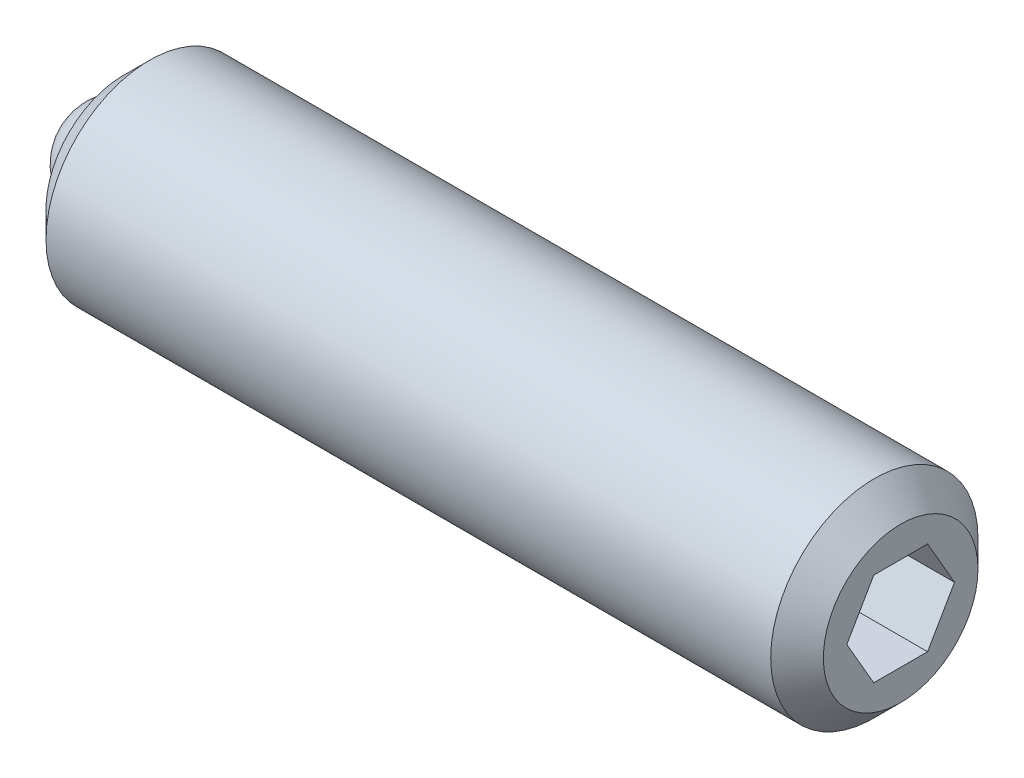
ISO-10303-21;
HEADER;
FILE_DESCRIPTION(('STEP AP214'),'2;1');
FILE_NAME('part.step','',(''),(''),'','','');
FILE_SCHEMA(('AUTOMOTIVE_DESIGN { 1 0 10303 214 1 1 1 1 }'));
ENDSEC;
DATA;
#1=APPLICATION_CONTEXT('core data for automotive mechanical design processes');
#2=APPLICATION_PROTOCOL_DEFINITION('international standard','automotive_design',2000,#1);
#3=PRODUCT_CONTEXT('',#1,'mechanical');
#4=PRODUCT('Part','Part','',(#3));
#5=PRODUCT_RELATED_PRODUCT_CATEGORY('part','',(#4));
#6=PRODUCT_DEFINITION_FORMATION('','',#4);
#7=PRODUCT_DEFINITION_CONTEXT('part definition',#1,'design');
#8=PRODUCT_DEFINITION('design','',#6,#7);
#9=PRODUCT_DEFINITION_SHAPE('','',#8);
#10=(LENGTH_UNIT() NAMED_UNIT(*) SI_UNIT(.MILLI.,.METRE.));
#11=(NAMED_UNIT(*) PLANE_ANGLE_UNIT() SI_UNIT($,.RADIAN.));
#12=(NAMED_UNIT(*) SI_UNIT($,.STERADIAN.) SOLID_ANGLE_UNIT());
#13=UNCERTAINTY_MEASURE_WITH_UNIT(LENGTH_MEASURE(1.E-05),#10,'distance_accuracy_value','');
#14=(GEOMETRIC_REPRESENTATION_CONTEXT(3) GLOBAL_UNCERTAINTY_ASSIGNED_CONTEXT((#13)) GLOBAL_UNIT_ASSIGNED_CONTEXT((#10,
#11,#12)) REPRESENTATION_CONTEXT('',''));
#15=CARTESIAN_POINT('',(0.,0.,0.));
#16=DIRECTION('',(0.,0.,1.));
#17=DIRECTION('',(1.,0.,0.));
#18=AXIS2_PLACEMENT_3D('',#15,#16,#17);
#19=CARTESIAN_POINT('',(0.,0.,0.));
#20=DIRECTION('',(0.,-1.,0.));
#21=DIRECTION('',(0.,0.,-1.));
#22=AXIS2_PLACEMENT_3D('',#19,#20,#21);
#23=SPHERICAL_SURFACE('',#22,0.5);
#24=CARTESIAN_POINT('',(0.,-0.5,0.));
#25=VERTEX_POINT('',#24);
#26=VERTEX_LOOP('',#25);
#27=FACE_BOUND('',#26,.T.);
#28=ADVANCED_FACE('F41',(#27),#23,.T.);
#29=CLOSED_SHELL('',(#28));
#30=MANIFOLD_SOLID_BREP('B2',#29);
#31=CARTESIAN_POINT('',(7.5,0.,0.));
#32=DIRECTION('',(-1.,0.,0.));
#33=DIRECTION('',(0.,0.,1.));
#34=AXIS2_PLACEMENT_3D('',#31,#32,#33);
#35=CYLINDRICAL_SURFACE('',#34,1.);
#36=CARTESIAN_POINT('',(7.246,0.,0.));
#37=DIRECTION('',(1.,0.,0.));
#38=DIRECTION('',(0.,0.,-1.));
#39=AXIS2_PLACEMENT_3D('',#36,#37,#38);
#40=CIRCLE('',#39,1.);
#41=CARTESIAN_POINT('',(7.246,0.,-1.));
#42=VERTEX_POINT('',#41);
#43=EDGE_CURVE('E39',#42,#42,#40,.F.);
#44=ORIENTED_EDGE('',*,*,#43,.T.);
#45=EDGE_LOOP('',(#44));
#46=FACE_BOUND('',#45,.T.);
#47=CARTESIAN_POINT('',(0.254000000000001,0.,0.));
#48=DIRECTION('',(1.,0.,0.));
#49=DIRECTION('',(0.,0.,-1.));
#50=AXIS2_PLACEMENT_3D('',#47,#48,#49);
#51=CIRCLE('',#50,1.);
#52=CARTESIAN_POINT('',(0.254000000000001,0.,-1.));
#53=VERTEX_POINT('',#52);
#54=EDGE_CURVE('E157',#53,#53,#51,.T.);
#55=ORIENTED_EDGE('',*,*,#54,.T.);
#56=EDGE_LOOP('',(#55));
#57=FACE_BOUND('',#56,.T.);
#58=ADVANCED_FACE('F54',(#46,#57),#35,.T.);
#59=CARTESIAN_POINT('',(7.5,0.,0.));
#60=DIRECTION('',(1.,0.,0.));
#61=DIRECTION('',(0.,0.,-1.));
#62=AXIS2_PLACEMENT_3D('',#59,#60,#61);
#63=PLANE('',#62);
#64=DIRECTION('',(0.,0.866025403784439,-0.5));
#65=VECTOR('',#64,1.);
#66=CARTESIAN_POINT('',(7.5,-0.45,-0.259807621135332));
#67=LINE('',#66,#65);
#68=CARTESIAN_POINT('',(7.5,-0.45,-0.259807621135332));
#69=VERTEX_POINT('',#68);
#70=CARTESIAN_POINT('',(7.5,0.,-0.519615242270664));
#71=VERTEX_POINT('',#70);
#72=EDGE_CURVE('E69',#69,#71,#67,.T.);
#73=ORIENTED_EDGE('',*,*,#72,.F.);
#74=DIRECTION('',(0.,0.,-1.));
#75=VECTOR('',#74,1.);
#76=CARTESIAN_POINT('',(7.5,-0.45,0.259807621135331));
#77=LINE('',#76,#75);
#78=CARTESIAN_POINT('',(7.5,-0.45,0.259807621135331));
#79=VERTEX_POINT('',#78);
#80=EDGE_CURVE('E153',#79,#69,#77,.T.);
#81=ORIENTED_EDGE('',*,*,#80,.F.);
#82=DIRECTION('',(0.,-0.866025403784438,-0.5));
#83=VECTOR('',#82,1.);
#84=CARTESIAN_POINT('',(7.5,0.,0.519615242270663));
#85=LINE('',#84,#83);
#86=CARTESIAN_POINT('',(7.5,0.,0.519615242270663));
#87=VERTEX_POINT('',#86);
#88=EDGE_CURVE('E151',#87,#79,#85,.T.);
#89=ORIENTED_EDGE('',*,*,#88,.F.);
#90=DIRECTION('',(0.,-0.866025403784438,0.5));
#91=VECTOR('',#90,1.);
#92=CARTESIAN_POINT('',(7.5,0.45,0.259807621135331));
#93=LINE('',#92,#91);
#94=CARTESIAN_POINT('',(7.5,0.45,0.259807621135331));
#95=VERTEX_POINT('',#94);
#96=EDGE_CURVE('E117',#95,#87,#93,.T.);
#97=ORIENTED_EDGE('',*,*,#96,.F.);
#98=DIRECTION('',(0.,0.,1.));
#99=VECTOR('',#98,1.);
#100=CARTESIAN_POINT('',(7.5,0.45,-0.259807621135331));
#101=LINE('',#100,#99);
#102=CARTESIAN_POINT('',(7.5,0.45,-0.259807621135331));
#103=VERTEX_POINT('',#102);
#104=EDGE_CURVE('E147',#103,#95,#101,.T.);
#105=ORIENTED_EDGE('',*,*,#104,.F.);
#106=DIRECTION('',(0.,0.866025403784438,0.5));
#107=VECTOR('',#106,1.);
#108=CARTESIAN_POINT('',(7.5,0.,-0.519615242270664));
#109=LINE('',#108,#107);
#110=EDGE_CURVE('E143',#71,#103,#109,.T.);
#111=ORIENTED_EDGE('',*,*,#110,.F.);
#112=EDGE_LOOP('',(#73,#81,#89,#97,#105,#111));
#113=FACE_BOUND('',#112,.T.);
#114=CARTESIAN_POINT('',(7.5,0.,0.));
#115=DIRECTION('',(1.,0.,0.));
#116=DIRECTION('',(0.,0.,-1.));
#117=AXIS2_PLACEMENT_3D('',#114,#115,#116);
#118=CIRCLE('',#117,0.746000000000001);
#119=CARTESIAN_POINT('',(7.5,0.,-0.746000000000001));
#120=VERTEX_POINT('',#119);
#121=EDGE_CURVE('E62',#120,#120,#118,.T.);
#122=ORIENTED_EDGE('',*,*,#121,.T.);
#123=EDGE_LOOP('',(#122));
#124=FACE_BOUND('',#123,.T.);
#125=ADVANCED_FACE('F170',(#113,#124),#63,.T.);
#126=CARTESIAN_POINT('',(0.,0.,0.));
#127=DIRECTION('',(1.,0.,0.));
#128=DIRECTION('',(0.,0.,-1.));
#129=AXIS2_PLACEMENT_3D('',#126,#127,#128);
#130=PLANE('',#129);
#131=CARTESIAN_POINT('',(0.,0.,0.));
#132=DIRECTION('',(-1.,0.,0.));
#133=DIRECTION('',(0.,0.,1.));
#134=AXIS2_PLACEMENT_3D('',#131,#132,#133);
#135=CIRCLE('',#134,0.5);
#136=CARTESIAN_POINT('',(0.,0.,0.5));
#137=VERTEX_POINT('',#136);
#138=EDGE_CURVE('E225',#137,#137,#135,.T.);
#139=ORIENTED_EDGE('',*,*,#138,.F.);
#140=EDGE_LOOP('',(#139));
#141=FACE_BOUND('',#140,.T.);
#142=CARTESIAN_POINT('',(0.,0.,0.));
#143=DIRECTION('',(1.,0.,0.));
#144=DIRECTION('',(0.,0.,-1.));
#145=AXIS2_PLACEMENT_3D('',#142,#143,#144);
#146=CIRCLE('',#145,0.745999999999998);
#147=CARTESIAN_POINT('',(0.,0.,-0.745999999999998));
#148=VERTEX_POINT('',#147);
#149=EDGE_CURVE('E165',#148,#148,#146,.F.);
#150=ORIENTED_EDGE('',*,*,#149,.T.);
#151=EDGE_LOOP('',(#150));
#152=FACE_BOUND('',#151,.T.);
#153=ADVANCED_FACE('F182',(#141,#152),#130,.F.);
#154=CARTESIAN_POINT('',(0.254000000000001,0.,0.));
#155=DIRECTION('',(1.,0.,0.));
#156=DIRECTION('',(0.,0.,-1.));
#157=AXIS2_PLACEMENT_3D('',#154,#155,#156);
#158=CONICAL_SURFACE('',#157,1.,0.78539816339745);
#159=ORIENTED_EDGE('',*,*,#149,.F.);
#160=EDGE_LOOP('',(#159));
#161=FACE_BOUND('',#160,.T.);
#162=ORIENTED_EDGE('',*,*,#54,.F.);
#163=EDGE_LOOP('',(#162));
#164=FACE_BOUND('',#163,.T.);
#165=ADVANCED_FACE('F174',(#161,#164),#158,.T.);
#166=CARTESIAN_POINT('',(7.5,0.,0.));
#167=DIRECTION('',(-1.,0.,0.));
#168=DIRECTION('',(0.,0.,1.));
#169=AXIS2_PLACEMENT_3D('',#166,#167,#168);
#170=CONICAL_SURFACE('',#169,0.746000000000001,0.785398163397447);
#171=ORIENTED_EDGE('',*,*,#43,.F.);
#172=EDGE_LOOP('',(#171));
#173=FACE_BOUND('',#172,.T.);
#174=ORIENTED_EDGE('',*,*,#121,.F.);
#175=EDGE_LOOP('',(#174));
#176=FACE_BOUND('',#175,.T.);
#177=ADVANCED_FACE('F56',(#173,#176),#170,.T.);
#178=CARTESIAN_POINT('',(5.5,-0.45,-0.259807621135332));
#179=DIRECTION('',(0.,-0.5,-0.866025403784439));
#180=DIRECTION('',(0.,0.866025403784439,-0.5));
#181=AXIS2_PLACEMENT_3D('',#178,#179,#180);
#182=PLANE('',#181);
#183=ORIENTED_EDGE('',*,*,#72,.T.);
#184=DIRECTION('',(1.,0.,0.));
#185=VECTOR('',#184,1.);
#186=CARTESIAN_POINT('',(5.5,0.,-0.519615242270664));
#187=LINE('',#186,#185);
#188=CARTESIAN_POINT('',(5.5,0.,-0.519615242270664));
#189=VERTEX_POINT('',#188);
#190=EDGE_CURVE('E99',#189,#71,#187,.T.);
#191=ORIENTED_EDGE('',*,*,#190,.F.);
#192=DIRECTION('',(0.,0.866025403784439,-0.5));
#193=VECTOR('',#192,1.);
#194=CARTESIAN_POINT('',(5.5,-0.45,-0.259807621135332));
#195=LINE('',#194,#193);
#196=CARTESIAN_POINT('',(5.5,-0.45,-0.259807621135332));
#197=VERTEX_POINT('',#196);
#198=EDGE_CURVE('E155',#197,#189,#195,.T.);
#199=ORIENTED_EDGE('',*,*,#198,.F.);
#200=DIRECTION('',(1.,0.,0.));
#201=VECTOR('',#200,1.);
#202=CARTESIAN_POINT('',(5.5,-0.45,-0.259807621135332));
#203=LINE('',#202,#201);
#204=EDGE_CURVE('E77',#197,#69,#203,.T.);
#205=ORIENTED_EDGE('',*,*,#204,.T.);
#206=EDGE_LOOP('',(#183,#191,#199,#205));
#207=FACE_BOUND('',#206,.T.);
#208=ADVANCED_FACE('F173',(#207),#182,.F.);
#209=CARTESIAN_POINT('',(5.5,-0.45,0.259807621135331));
#210=DIRECTION('',(0.,-1.,0.));
#211=DIRECTION('',(0.,0.,-1.));
#212=AXIS2_PLACEMENT_3D('',#209,#210,#211);
#213=PLANE('',#212);
#214=ORIENTED_EDGE('',*,*,#80,.T.);
#215=ORIENTED_EDGE('',*,*,#204,.F.);
#216=DIRECTION('',(0.,0.,-1.));
#217=VECTOR('',#216,1.);
#218=CARTESIAN_POINT('',(5.5,-0.45,0.259807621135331));
#219=LINE('',#218,#217);
#220=CARTESIAN_POINT('',(5.5,-0.45,0.259807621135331));
#221=VERTEX_POINT('',#220);
#222=EDGE_CURVE('E129',#221,#197,#219,.T.);
#223=ORIENTED_EDGE('',*,*,#222,.F.);
#224=DIRECTION('',(1.,0.,0.));
#225=VECTOR('',#224,1.);
#226=CARTESIAN_POINT('',(5.5,-0.45,0.259807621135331));
#227=LINE('',#226,#225);
#228=EDGE_CURVE('E121',#221,#79,#227,.T.);
#229=ORIENTED_EDGE('',*,*,#228,.T.);
#230=EDGE_LOOP('',(#214,#215,#223,#229));
#231=FACE_BOUND('',#230,.T.);
#232=ADVANCED_FACE('F180',(#231),#213,.F.);
#233=CARTESIAN_POINT('',(5.5,0.,0.519615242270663));
#234=DIRECTION('',(0.,-0.5,0.866025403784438));
#235=DIRECTION('',(0.,-0.866025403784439,-0.5));
#236=AXIS2_PLACEMENT_3D('',#233,#234,#235);
#237=PLANE('',#236);
#238=ORIENTED_EDGE('',*,*,#88,.T.);
#239=ORIENTED_EDGE('',*,*,#228,.F.);
#240=DIRECTION('',(0.,-0.866025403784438,-0.5));
#241=VECTOR('',#240,1.);
#242=CARTESIAN_POINT('',(5.5,0.,0.519615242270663));
#243=LINE('',#242,#241);
#244=CARTESIAN_POINT('',(5.5,0.,0.519615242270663));
#245=VERTEX_POINT('',#244);
#246=EDGE_CURVE('E125',#245,#221,#243,.T.);
#247=ORIENTED_EDGE('',*,*,#246,.F.);
#248=DIRECTION('',(1.,0.,0.));
#249=VECTOR('',#248,1.);
#250=CARTESIAN_POINT('',(5.5,0.,0.519615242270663));
#251=LINE('',#250,#249);
#252=EDGE_CURVE('E110',#245,#87,#251,.T.);
#253=ORIENTED_EDGE('',*,*,#252,.T.);
#254=EDGE_LOOP('',(#238,#239,#247,#253));
#255=FACE_BOUND('',#254,.T.);
#256=ADVANCED_FACE('F126',(#255),#237,.F.);
#257=CARTESIAN_POINT('',(5.5,0.45,0.259807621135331));
#258=DIRECTION('',(0.,0.5,0.866025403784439));
#259=DIRECTION('',(0.,-0.866025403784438,0.5));
#260=AXIS2_PLACEMENT_3D('',#257,#258,#259);
#261=PLANE('',#260);
#262=ORIENTED_EDGE('',*,*,#96,.T.);
#263=ORIENTED_EDGE('',*,*,#252,.F.);
#264=DIRECTION('',(0.,-0.866025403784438,0.5));
#265=VECTOR('',#264,1.);
#266=CARTESIAN_POINT('',(5.5,0.45,0.259807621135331));
#267=LINE('',#266,#265);
#268=CARTESIAN_POINT('',(5.5,0.45,0.259807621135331));
#269=VERTEX_POINT('',#268);
#270=EDGE_CURVE('E114',#269,#245,#267,.T.);
#271=ORIENTED_EDGE('',*,*,#270,.F.);
#272=DIRECTION('',(1.,0.,0.));
#273=VECTOR('',#272,1.);
#274=CARTESIAN_POINT('',(5.5,0.45,0.259807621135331));
#275=LINE('',#274,#273);
#276=EDGE_CURVE('E122',#269,#95,#275,.T.);
#277=ORIENTED_EDGE('',*,*,#276,.T.);
#278=EDGE_LOOP('',(#262,#263,#271,#277));
#279=FACE_BOUND('',#278,.T.);
#280=ADVANCED_FACE('F112',(#279),#261,.F.);
#281=CARTESIAN_POINT('',(5.5,0.45,-0.259807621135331));
#282=DIRECTION('',(0.,1.,0.));
#283=DIRECTION('',(0.,0.,1.));
#284=AXIS2_PLACEMENT_3D('',#281,#282,#283);
#285=PLANE('',#284);
#286=ORIENTED_EDGE('',*,*,#104,.T.);
#287=ORIENTED_EDGE('',*,*,#276,.F.);
#288=DIRECTION('',(0.,0.,1.));
#289=VECTOR('',#288,1.);
#290=CARTESIAN_POINT('',(5.5,0.45,-0.259807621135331));
#291=LINE('',#290,#289);
#292=CARTESIAN_POINT('',(5.5,0.45,-0.259807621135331));
#293=VERTEX_POINT('',#292);
#294=EDGE_CURVE('E135',#293,#269,#291,.T.);
#295=ORIENTED_EDGE('',*,*,#294,.F.);
#296=DIRECTION('',(1.,0.,0.));
#297=VECTOR('',#296,1.);
#298=CARTESIAN_POINT('',(5.5,0.45,-0.259807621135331));
#299=LINE('',#298,#297);
#300=EDGE_CURVE('E160',#293,#103,#299,.T.);
#301=ORIENTED_EDGE('',*,*,#300,.T.);
#302=EDGE_LOOP('',(#286,#287,#295,#301));
#303=FACE_BOUND('',#302,.T.);
#304=ADVANCED_FACE('F201',(#303),#285,.F.);
#305=CARTESIAN_POINT('',(5.5,0.,-0.519615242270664));
#306=DIRECTION('',(0.,0.5,-0.866025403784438));
#307=DIRECTION('',(0.,0.866025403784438,0.5));
#308=AXIS2_PLACEMENT_3D('',#305,#306,#307);
#309=PLANE('',#308);
#310=ORIENTED_EDGE('',*,*,#110,.T.);
#311=ORIENTED_EDGE('',*,*,#300,.F.);
#312=DIRECTION('',(0.,0.866025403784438,0.5));
#313=VECTOR('',#312,1.);
#314=CARTESIAN_POINT('',(5.5,0.,-0.519615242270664));
#315=LINE('',#314,#313);
#316=EDGE_CURVE('E137',#189,#293,#315,.T.);
#317=ORIENTED_EDGE('',*,*,#316,.F.);
#318=ORIENTED_EDGE('',*,*,#190,.T.);
#319=EDGE_LOOP('',(#310,#311,#317,#318));
#320=FACE_BOUND('',#319,.T.);
#321=ADVANCED_FACE('F198',(#320),#309,.F.);
#322=CARTESIAN_POINT('',(5.5,0.,0.));
#323=DIRECTION('',(1.,0.,0.));
#324=DIRECTION('',(0.,0.,-1.));
#325=AXIS2_PLACEMENT_3D('',#322,#323,#324);
#326=PLANE('',#325);
#327=ORIENTED_EDGE('',*,*,#198,.T.);
#328=ORIENTED_EDGE('',*,*,#316,.T.);
#329=ORIENTED_EDGE('',*,*,#294,.T.);
#330=ORIENTED_EDGE('',*,*,#270,.T.);
#331=ORIENTED_EDGE('',*,*,#246,.T.);
#332=ORIENTED_EDGE('',*,*,#222,.T.);
#333=EDGE_LOOP('',(#327,#328,#329,#330,#331,#332));
#334=FACE_BOUND('',#333,.T.);
#335=ADVANCED_FACE('F132',(#334),#326,.T.);
#336=CARTESIAN_POINT('',(0.5,0.,0.));
#337=DIRECTION('',(-1.,0.,0.));
#338=DIRECTION('',(0.,0.,1.));
#339=AXIS2_PLACEMENT_3D('',#336,#337,#338);
#340=CYLINDRICAL_SURFACE('',#339,0.5);
#341=CARTESIAN_POINT('',(0.5,0.,0.));
#342=DIRECTION('',(-1.,0.,0.));
#343=DIRECTION('',(0.,0.,1.));
#344=AXIS2_PLACEMENT_3D('',#341,#342,#343);
#345=CIRCLE('',#344,0.5);
#346=CARTESIAN_POINT('',(0.5,0.,0.5));
#347=VERTEX_POINT('',#346);
#348=EDGE_CURVE('E144',#347,#347,#345,.T.);
#349=ORIENTED_EDGE('',*,*,#348,.F.);
#350=EDGE_LOOP('',(#349));
#351=FACE_BOUND('',#350,.T.);
#352=ORIENTED_EDGE('',*,*,#138,.T.);
#353=EDGE_LOOP('',(#352));
#354=FACE_BOUND('',#353,.T.);
#355=ADVANCED_FACE('F214',(#351,#354),#340,.F.);
#356=CARTESIAN_POINT('',(0.5,0.,0.));
#357=DIRECTION('',(-1.,0.,0.));
#358=DIRECTION('',(0.,0.,1.));
#359=AXIS2_PLACEMENT_3D('',#356,#357,#358);
#360=PLANE('',#359);
#361=ORIENTED_EDGE('',*,*,#348,.T.);
#362=EDGE_LOOP('',(#361));
#363=FACE_BOUND('',#362,.T.);
#364=ADVANCED_FACE('F217',(#363),#360,.T.);
#365=CLOSED_SHELL('',(#58,#125,#153,#165,#177,#208,#232,#256,#280,#304,#321,#335,#355,#364));
#366=MANIFOLD_SOLID_BREP('B6',#365);
#367=ADVANCED_BREP_SHAPE_REPRESENTATION('',(#18,#30,#366),#14);
#368=SHAPE_DEFINITION_REPRESENTATION(#9,#367);
ENDSEC;
END-ISO-10303-21;
